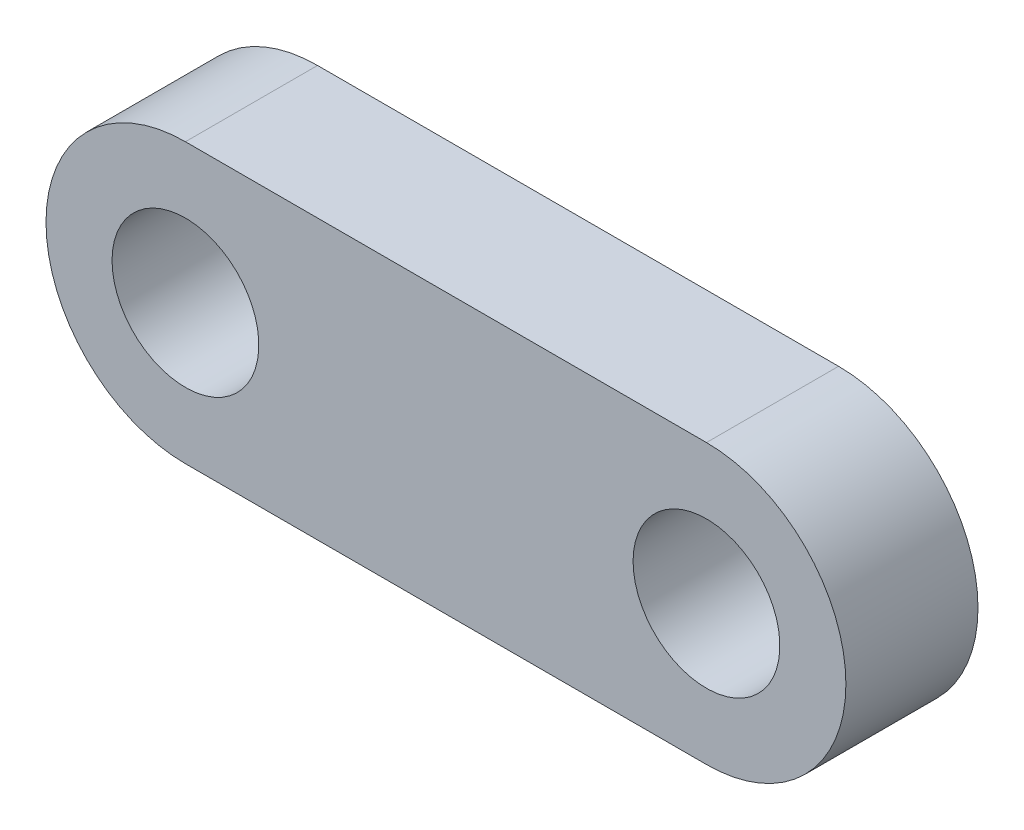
ISO-10303-21;
HEADER;
FILE_DESCRIPTION(('STEP AP214'),'2;1');
FILE_NAME('part.step','',(''),(''),'','','');
FILE_SCHEMA(('AUTOMOTIVE_DESIGN { 1 0 10303 214 1 1 1 1 }'));
ENDSEC;
DATA;
#1=APPLICATION_CONTEXT('core data for automotive mechanical design processes');
#2=APPLICATION_PROTOCOL_DEFINITION('international standard','automotive_design',2000,#1);
#3=PRODUCT_CONTEXT('',#1,'mechanical');
#4=PRODUCT('Part','Part','',(#3));
#5=PRODUCT_RELATED_PRODUCT_CATEGORY('part','',(#4));
#6=PRODUCT_DEFINITION_FORMATION('','',#4);
#7=PRODUCT_DEFINITION_CONTEXT('part definition',#1,'design');
#8=PRODUCT_DEFINITION('design','',#6,#7);
#9=PRODUCT_DEFINITION_SHAPE('','',#8);
#10=(LENGTH_UNIT() NAMED_UNIT(*) SI_UNIT(.MILLI.,.METRE.));
#11=(NAMED_UNIT(*) PLANE_ANGLE_UNIT() SI_UNIT($,.RADIAN.));
#12=(NAMED_UNIT(*) SI_UNIT($,.STERADIAN.) SOLID_ANGLE_UNIT());
#13=UNCERTAINTY_MEASURE_WITH_UNIT(LENGTH_MEASURE(1.E-05),#10,'distance_accuracy_value','');
#14=(GEOMETRIC_REPRESENTATION_CONTEXT(3) GLOBAL_UNCERTAINTY_ASSIGNED_CONTEXT((#13)) GLOBAL_UNIT_ASSIGNED_CONTEXT((#10,
#11,#12)) REPRESENTATION_CONTEXT('',''));
#15=CARTESIAN_POINT('',(0.,0.,0.));
#16=DIRECTION('',(0.,0.,1.));
#17=DIRECTION('',(1.,0.,0.));
#18=AXIS2_PLACEMENT_3D('',#15,#16,#17);
#19=CARTESIAN_POINT('',(-17.75,0.,9.));
#20=DIRECTION('',(0.,0.,1.));
#21=DIRECTION('',(1.,0.,0.));
#22=AXIS2_PLACEMENT_3D('',#19,#20,#21);
#23=PLANE('',#22);
#24=CARTESIAN_POINT('',(17.75,0.,9.));
#25=DIRECTION('',(0.,0.,-1.));
#26=DIRECTION('',(-1.,0.,0.));
#27=AXIS2_PLACEMENT_3D('',#24,#25,#26);
#28=CIRCLE('',#27,5.);
#29=CARTESIAN_POINT('',(12.75,0.,9.));
#30=VERTEX_POINT('',#29);
#31=EDGE_CURVE('E91',#30,#30,#28,.T.);
#32=ORIENTED_EDGE('',*,*,#31,.T.);
#33=EDGE_LOOP('',(#32));
#34=FACE_BOUND('',#33,.T.);
#35=CARTESIAN_POINT('',(17.75,0.,9.));
#36=DIRECTION('',(0.,0.,-1.));
#37=DIRECTION('',(-1.,0.,0.));
#38=AXIS2_PLACEMENT_3D('',#35,#36,#37);
#39=CIRCLE('',#38,9.5);
#40=CARTESIAN_POINT('',(17.75,9.50000000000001,9.));
#41=VERTEX_POINT('',#40);
#42=CARTESIAN_POINT('',(17.75,-9.49999999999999,9.));
#43=VERTEX_POINT('',#42);
#44=EDGE_CURVE('E20',#41,#43,#39,.T.);
#45=ORIENTED_EDGE('',*,*,#44,.F.);
#46=DIRECTION('',(1.,0.,0.));
#47=VECTOR('',#46,1.);
#48=CARTESIAN_POINT('',(-17.75,9.5,9.));
#49=LINE('',#48,#47);
#50=CARTESIAN_POINT('',(-17.75,9.5,9.));
#51=VERTEX_POINT('',#50);
#52=EDGE_CURVE('E65',#41,#51,#49,.F.);
#53=ORIENTED_EDGE('',*,*,#52,.T.);
#54=CARTESIAN_POINT('',(-17.75,0.,9.));
#55=DIRECTION('',(0.,0.,-1.));
#56=DIRECTION('',(-1.,0.,0.));
#57=AXIS2_PLACEMENT_3D('',#54,#55,#56);
#58=CIRCLE('',#57,9.5);
#59=CARTESIAN_POINT('',(-17.75,-9.5,9.));
#60=VERTEX_POINT('',#59);
#61=EDGE_CURVE('E59',#60,#51,#58,.T.);
#62=ORIENTED_EDGE('',*,*,#61,.F.);
#63=DIRECTION('',(-1.,0.,0.));
#64=VECTOR('',#63,1.);
#65=CARTESIAN_POINT('',(-17.75,-9.5,9.));
#66=LINE('',#65,#64);
#67=EDGE_CURVE('E62',#60,#43,#66,.F.);
#68=ORIENTED_EDGE('',*,*,#67,.T.);
#69=EDGE_LOOP('',(#45,#53,#62,#68));
#70=FACE_BOUND('',#69,.T.);
#71=CARTESIAN_POINT('',(-17.75,0.,9.));
#72=DIRECTION('',(0.,0.,-1.));
#73=DIRECTION('',(-1.,0.,0.));
#74=AXIS2_PLACEMENT_3D('',#71,#72,#73);
#75=CIRCLE('',#74,5.);
#76=CARTESIAN_POINT('',(-22.75,0.,9.));
#77=VERTEX_POINT('',#76);
#78=EDGE_CURVE('E94',#77,#77,#75,.T.);
#79=ORIENTED_EDGE('',*,*,#78,.T.);
#80=EDGE_LOOP('',(#79));
#81=FACE_BOUND('',#80,.T.);
#82=ADVANCED_FACE('F17',(#34,#70,#81),#23,.T.);
#83=CARTESIAN_POINT('',(-17.75,-9.5,9.));
#84=DIRECTION('',(0.,1.,0.));
#85=DIRECTION('',(-1.,0.,0.));
#86=AXIS2_PLACEMENT_3D('',#83,#84,#85);
#87=PLANE('',#86);
#88=DIRECTION('',(0.,0.,-1.));
#89=VECTOR('',#88,1.);
#90=CARTESIAN_POINT('',(17.75,-9.5,9.));
#91=LINE('',#90,#89);
#92=CARTESIAN_POINT('',(17.75,-9.5,0.));
#93=VERTEX_POINT('',#92);
#94=EDGE_CURVE('E74',#43,#93,#91,.T.);
#95=ORIENTED_EDGE('',*,*,#94,.F.);
#96=ORIENTED_EDGE('',*,*,#67,.F.);
#97=DIRECTION('',(0.,0.,1.));
#98=VECTOR('',#97,1.);
#99=CARTESIAN_POINT('',(-17.75,-9.5,9.));
#100=LINE('',#99,#98);
#101=CARTESIAN_POINT('',(-17.75,-9.5,0.));
#102=VERTEX_POINT('',#101);
#103=EDGE_CURVE('E73',#102,#60,#100,.T.);
#104=ORIENTED_EDGE('',*,*,#103,.F.);
#105=DIRECTION('',(1.,0.,0.));
#106=VECTOR('',#105,1.);
#107=CARTESIAN_POINT('',(-17.75,-9.5,0.));
#108=LINE('',#107,#106);
#109=EDGE_CURVE('E89',#102,#93,#108,.T.);
#110=ORIENTED_EDGE('',*,*,#109,.T.);
#111=EDGE_LOOP('',(#95,#96,#104,#110));
#112=FACE_BOUND('',#111,.T.);
#113=ADVANCED_FACE('F71',(#112),#87,.F.);
#114=CARTESIAN_POINT('',(17.75,0.,9.));
#115=DIRECTION('',(0.,0.,-1.));
#116=DIRECTION('',(-1.,0.,0.));
#117=AXIS2_PLACEMENT_3D('',#114,#115,#116);
#118=CYLINDRICAL_SURFACE('',#117,9.5);
#119=ORIENTED_EDGE('',*,*,#44,.T.);
#120=ORIENTED_EDGE('',*,*,#94,.T.);
#121=CARTESIAN_POINT('',(17.75,0.,0.));
#122=DIRECTION('',(0.,0.,-1.));
#123=DIRECTION('',(-1.,0.,0.));
#124=AXIS2_PLACEMENT_3D('',#121,#122,#123);
#125=CIRCLE('',#124,9.5);
#126=CARTESIAN_POINT('',(17.75,9.50000000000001,0.));
#127=VERTEX_POINT('',#126);
#128=EDGE_CURVE('E86',#93,#127,#125,.F.);
#129=ORIENTED_EDGE('',*,*,#128,.T.);
#130=DIRECTION('',(0.,0.,1.));
#131=VECTOR('',#130,1.);
#132=CARTESIAN_POINT('',(17.75,9.50000000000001,9.));
#133=LINE('',#132,#131);
#134=EDGE_CURVE('E81',#127,#41,#133,.T.);
#135=ORIENTED_EDGE('',*,*,#134,.T.);
#136=EDGE_LOOP('',(#119,#120,#129,#135));
#137=FACE_BOUND('',#136,.T.);
#138=ADVANCED_FACE('F102',(#137),#118,.T.);
#139=CARTESIAN_POINT('',(-17.75,9.5,9.));
#140=DIRECTION('',(0.,-1.,0.));
#141=DIRECTION('',(1.,0.,0.));
#142=AXIS2_PLACEMENT_3D('',#139,#140,#141);
#143=PLANE('',#142);
#144=DIRECTION('',(0.,0.,-1.));
#145=VECTOR('',#144,1.);
#146=CARTESIAN_POINT('',(-17.75,9.5,9.));
#147=LINE('',#146,#145);
#148=CARTESIAN_POINT('',(-17.75,9.5,0.));
#149=VERTEX_POINT('',#148);
#150=EDGE_CURVE('E69',#51,#149,#147,.T.);
#151=ORIENTED_EDGE('',*,*,#150,.F.);
#152=ORIENTED_EDGE('',*,*,#52,.F.);
#153=ORIENTED_EDGE('',*,*,#134,.F.);
#154=DIRECTION('',(1.,0.,0.));
#155=VECTOR('',#154,1.);
#156=CARTESIAN_POINT('',(-17.75,9.50000000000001,0.));
#157=LINE('',#156,#155);
#158=EDGE_CURVE('E85',#127,#149,#157,.F.);
#159=ORIENTED_EDGE('',*,*,#158,.T.);
#160=EDGE_LOOP('',(#151,#152,#153,#159));
#161=FACE_BOUND('',#160,.T.);
#162=ADVANCED_FACE('F105',(#161),#143,.F.);
#163=CARTESIAN_POINT('',(-17.75,0.,9.));
#164=DIRECTION('',(0.,0.,-1.));
#165=DIRECTION('',(-1.,0.,0.));
#166=AXIS2_PLACEMENT_3D('',#163,#164,#165);
#167=CYLINDRICAL_SURFACE('',#166,9.5);
#168=ORIENTED_EDGE('',*,*,#150,.T.);
#169=CARTESIAN_POINT('',(-17.75,0.,0.));
#170=DIRECTION('',(0.,0.,-1.));
#171=DIRECTION('',(-1.,0.,0.));
#172=AXIS2_PLACEMENT_3D('',#169,#170,#171);
#173=CIRCLE('',#172,9.5);
#174=EDGE_CURVE('E35',#149,#102,#173,.F.);
#175=ORIENTED_EDGE('',*,*,#174,.T.);
#176=ORIENTED_EDGE('',*,*,#103,.T.);
#177=ORIENTED_EDGE('',*,*,#61,.T.);
#178=EDGE_LOOP('',(#168,#175,#176,#177));
#179=FACE_BOUND('',#178,.T.);
#180=ADVANCED_FACE('F76',(#179),#167,.T.);
#181=CARTESIAN_POINT('',(-17.75,0.,9.));
#182=DIRECTION('',(0.,0.,-1.));
#183=DIRECTION('',(-1.,0.,0.));
#184=AXIS2_PLACEMENT_3D('',#181,#182,#183);
#185=CYLINDRICAL_SURFACE('',#184,5.);
#186=CARTESIAN_POINT('',(-17.75,0.,0.));
#187=DIRECTION('',(0.,0.,-1.));
#188=DIRECTION('',(-1.,0.,0.));
#189=AXIS2_PLACEMENT_3D('',#186,#187,#188);
#190=CIRCLE('',#189,5.);
#191=CARTESIAN_POINT('',(-22.75,0.,0.));
#192=VERTEX_POINT('',#191);
#193=EDGE_CURVE('E26',#192,#192,#190,.T.);
#194=ORIENTED_EDGE('',*,*,#193,.T.);
#195=EDGE_LOOP('',(#194));
#196=FACE_BOUND('',#195,.T.);
#197=ORIENTED_EDGE('',*,*,#78,.F.);
#198=EDGE_LOOP('',(#197));
#199=FACE_BOUND('',#198,.T.);
#200=ADVANCED_FACE('F113',(#196,#199),#185,.F.);
#201=CARTESIAN_POINT('',(17.75,0.,9.));
#202=DIRECTION('',(0.,0.,-1.));
#203=DIRECTION('',(-1.,0.,0.));
#204=AXIS2_PLACEMENT_3D('',#201,#202,#203);
#205=CYLINDRICAL_SURFACE('',#204,5.);
#206=CARTESIAN_POINT('',(17.75,0.,0.));
#207=DIRECTION('',(0.,0.,-1.));
#208=DIRECTION('',(-1.,0.,0.));
#209=AXIS2_PLACEMENT_3D('',#206,#207,#208);
#210=CIRCLE('',#209,5.);
#211=CARTESIAN_POINT('',(12.75,0.,0.));
#212=VERTEX_POINT('',#211);
#213=EDGE_CURVE('E11',#212,#212,#210,.T.);
#214=ORIENTED_EDGE('',*,*,#213,.T.);
#215=EDGE_LOOP('',(#214));
#216=FACE_BOUND('',#215,.T.);
#217=ORIENTED_EDGE('',*,*,#31,.F.);
#218=EDGE_LOOP('',(#217));
#219=FACE_BOUND('',#218,.T.);
#220=ADVANCED_FACE('F117',(#216,#219),#205,.F.);
#221=CARTESIAN_POINT('',(-17.75,0.,0.));
#222=DIRECTION('',(0.,0.,1.));
#223=DIRECTION('',(1.,0.,0.));
#224=AXIS2_PLACEMENT_3D('',#221,#222,#223);
#225=PLANE('',#224);
#226=ORIENTED_EDGE('',*,*,#213,.F.);
#227=EDGE_LOOP('',(#226));
#228=FACE_BOUND('',#227,.T.);
#229=ORIENTED_EDGE('',*,*,#193,.F.);
#230=EDGE_LOOP('',(#229));
#231=FACE_BOUND('',#230,.T.);
#232=ORIENTED_EDGE('',*,*,#158,.F.);
#233=ORIENTED_EDGE('',*,*,#128,.F.);
#234=ORIENTED_EDGE('',*,*,#109,.F.);
#235=ORIENTED_EDGE('',*,*,#174,.F.);
#236=EDGE_LOOP('',(#232,#233,#234,#235));
#237=FACE_BOUND('',#236,.T.);
#238=ADVANCED_FACE('F103',(#228,#231,#237),#225,.F.);
#239=CLOSED_SHELL('',(#82,#113,#138,#162,#180,#200,#220,#238));
#240=MANIFOLD_SOLID_BREP('B1',#239);
#241=ADVANCED_BREP_SHAPE_REPRESENTATION('',(#18,#240),#14);
#242=SHAPE_DEFINITION_REPRESENTATION(#9,#241);
ENDSEC;
END-ISO-10303-21;
